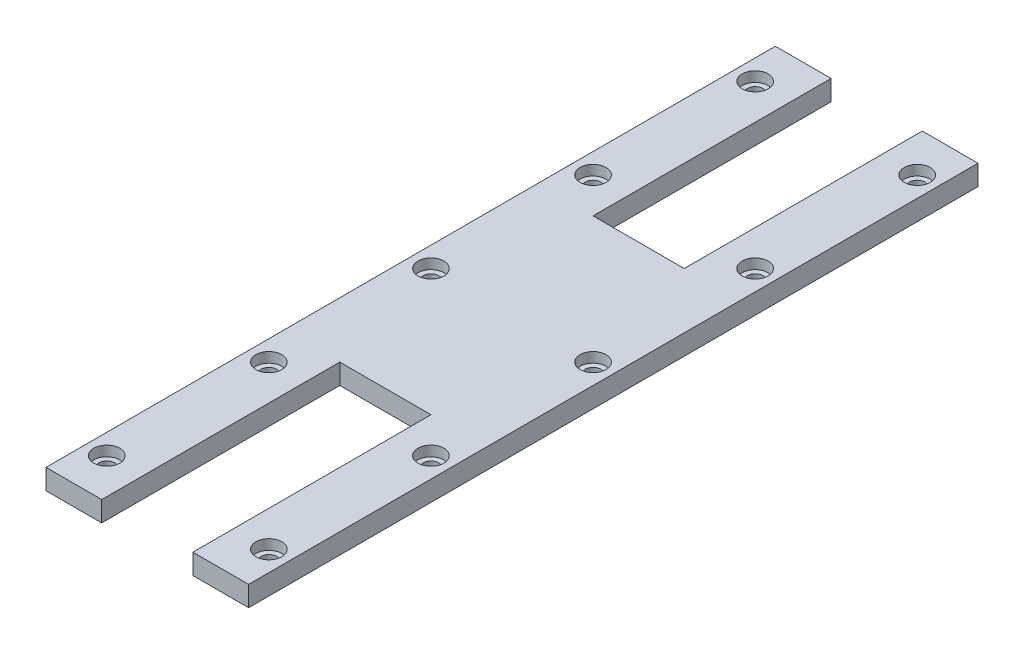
from build123d import *

# Parameters (mm, degrees)
SKETCH1_W           = 63.5
SKETCH1_H           = 6.35
BOSS_EXTRUDE1_DEPTH = 228.6
SKETCH2_W           = 28.575
SKETCH2_H           = 74.6125
CUT_EXTRUDE1_DEPTH  = 127
SKETCH3_R           = 2.45745
CUT_EXTRUDE2_DEPTH  = 6.35
SKETCH4_R           = 4.064
CUT_EXTRUDE3_DEPTH  = 3.175


with BuildPart() as part:
    # Sketch1 → Boss-Extrude1 (new body)
    with BuildSketch(Plane.XY):
        with Locations((31.75, 3.175)):
            Rectangle(SKETCH1_W, SKETCH1_H)
    extrude(amount=-BOSS_EXTRUDE1_DEPTH)

    # Sketch2 → Cut-Extrude1 (cut)
    with BuildSketch(Plane(origin=(0, 6.35, 0), x_dir=(1, 0, 0), z_dir=(0, 1, 0))):
        with Locations((31.75, 191.29375)):
            Rectangle(SKETCH2_W, SKETCH2_H)
        with Locations((31.75, 37.30625)):
            Rectangle(SKETCH2_W, SKETCH2_H)
    extrude(amount=-CUT_EXTRUDE1_DEPTH, mode=Mode.SUBTRACT)

    # Sketch3 → Cut-Extrude2 (cut)
    with BuildSketch(Plane(origin=(0, 6.35, 0), x_dir=(1, 0, 0), z_dir=(0, 1, 0))):
        with Locations(Location((6.35, 215.9, 0), (0, 0, 270))):
            Circle(SKETCH3_R)
        with Locations(Location((6.35, 165.1, 0), (0, 0, 270))):
            Circle(SKETCH3_R)
        with Locations(Location((6.35, 114.3, 0), (0, 0, 270))):
            Circle(SKETCH3_R)
        with Locations(Location((57.15, 165.1, 0), (0, 0, 270))):
            Circle(SKETCH3_R)
        with Locations(Location((57.15, 114.3, 0), (0, 0, 270))):
            Circle(SKETCH3_R)
        with Locations(Location((57.15, 63.5, 0), (0, 0, 270))):
            Circle(SKETCH3_R)
        with Locations(Location((6.35, 63.5, 0), (0, 0, 270))):
            Circle(SKETCH3_R)
        with Locations(Location((57.15, 215.9, 0), (0, 0, 270))):
            Circle(SKETCH3_R)
        with Locations(Location((6.35, 12.7, 0), (0, 0, 270))):
            Circle(SKETCH3_R)
        with Locations(Location((57.15, 12.7, 0), (0, 0, 270))):
            Circle(SKETCH3_R)
    extrude(amount=-CUT_EXTRUDE2_DEPTH, mode=Mode.SUBTRACT)

    # Sketch4 → Cut-Extrude3 (cut)
    with BuildSketch(Plane(origin=(0, 6.35, 0), x_dir=(1, 0, 0), z_dir=(0, 1, 0))):
        with Locations(Location((6.35, 215.9, 0), (0, 0, 270))):
            Circle(SKETCH4_R)
        with Locations(Location((6.35, 63.5, 0), (0, 0, 270))):
            Circle(SKETCH4_R)
        with Locations(Location((6.35, 165.1, 0), (0, 0, 270))):
            Circle(SKETCH4_R)
        with Locations(Location((6.35, 114.3, 0), (0, 0, 270))):
            Circle(SKETCH4_R)
        with Locations(Location((57.15, 63.5, 0), (0, 0, 270))):
            Circle(SKETCH4_R)
        with Locations(Location((57.15, 114.3, 0), (0, 0, 270))):
            Circle(SKETCH4_R)
        with Locations(Location((57.15, 165.1, 0), (0, 0, 270))):
            Circle(SKETCH4_R)
        with Locations(Location((57.15, 12.7, 0), (0, 0, 270))):
            Circle(SKETCH4_R)
        with Locations(Location((57.15, 215.9, 0), (0, 0, 270))):
            Circle(SKETCH4_R)
        with Locations(Location((6.35, 12.7, 0), (0, 0, 270))):
            Circle(SKETCH4_R)
    extrude(amount=-CUT_EXTRUDE3_DEPTH, mode=Mode.SUBTRACT)


solid = part.part
